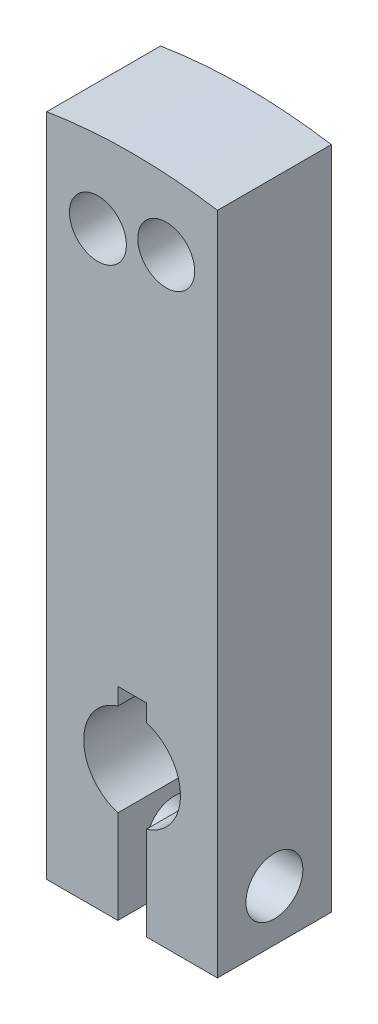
ISO-10303-21;
HEADER;
FILE_DESCRIPTION(('STEP AP214'),'2;1');
FILE_NAME('part.step','',(''),(''),'','','');
FILE_SCHEMA(('AUTOMOTIVE_DESIGN { 1 0 10303 214 1 1 1 1 }'));
ENDSEC;
DATA;
#1=APPLICATION_CONTEXT('core data for automotive mechanical design processes');
#2=APPLICATION_PROTOCOL_DEFINITION('international standard','automotive_design',2000,#1);
#3=PRODUCT_CONTEXT('',#1,'mechanical');
#4=PRODUCT('Part','Part','',(#3));
#5=PRODUCT_RELATED_PRODUCT_CATEGORY('part','',(#4));
#6=PRODUCT_DEFINITION_FORMATION('','',#4);
#7=PRODUCT_DEFINITION_CONTEXT('part definition',#1,'design');
#8=PRODUCT_DEFINITION('design','',#6,#7);
#9=PRODUCT_DEFINITION_SHAPE('','',#8);
#10=(LENGTH_UNIT() NAMED_UNIT(*) SI_UNIT(.MILLI.,.METRE.));
#11=(NAMED_UNIT(*) PLANE_ANGLE_UNIT() SI_UNIT($,.RADIAN.));
#12=(NAMED_UNIT(*) SI_UNIT($,.STERADIAN.) SOLID_ANGLE_UNIT());
#13=UNCERTAINTY_MEASURE_WITH_UNIT(LENGTH_MEASURE(1.E-05),#10,'distance_accuracy_value','');
#14=(GEOMETRIC_REPRESENTATION_CONTEXT(3) GLOBAL_UNCERTAINTY_ASSIGNED_CONTEXT((#13)) GLOBAL_UNIT_ASSIGNED_CONTEXT((#10,
#11,#12)) REPRESENTATION_CONTEXT('',''));
#15=CARTESIAN_POINT('',(0.,0.,0.));
#16=DIRECTION('',(0.,0.,1.));
#17=DIRECTION('',(1.,0.,0.));
#18=AXIS2_PLACEMENT_3D('',#15,#16,#17);
#19=CARTESIAN_POINT('',(0.,0.,-20.));
#20=DIRECTION('',(0.,0.,1.));
#21=DIRECTION('',(1.,0.,0.));
#22=AXIS2_PLACEMENT_3D('',#19,#20,#21);
#23=CYLINDRICAL_SURFACE('',#22,8.5);
#24=CARTESIAN_POINT('',(0.,0.,0.));
#25=DIRECTION('',(0.,0.,-1.));
#26=DIRECTION('',(1.,0.,0.));
#27=AXIS2_PLACEMENT_3D('',#24,#25,#26);
#28=CIRCLE('',#27,8.5);
#29=CARTESIAN_POINT('',(-2.5,-8.12403840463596,0.));
#30=VERTEX_POINT('',#29);
#31=CARTESIAN_POINT('',(-2.49999999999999,8.12403840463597,0.));
#32=VERTEX_POINT('',#31);
#33=EDGE_CURVE('E126',#30,#32,#28,.T.);
#34=ORIENTED_EDGE('',*,*,#33,.F.);
#35=DIRECTION('',(0.,0.,1.));
#36=VECTOR('',#35,1.);
#37=CARTESIAN_POINT('',(-2.5,-8.12403840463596,-20.));
#38=LINE('',#37,#36);
#39=CARTESIAN_POINT('',(-2.5,-8.12403840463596,-20.));
#40=VERTEX_POINT('',#39);
#41=EDGE_CURVE('E12',#40,#30,#38,.T.);
#42=ORIENTED_EDGE('',*,*,#41,.F.);
#43=CARTESIAN_POINT('',(0.,0.,-20.));
#44=DIRECTION('',(0.,0.,-1.));
#45=DIRECTION('',(1.,0.,0.));
#46=AXIS2_PLACEMENT_3D('',#43,#44,#45);
#47=CIRCLE('',#46,8.5);
#48=CARTESIAN_POINT('',(-2.49999999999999,8.12403840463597,-20.));
#49=VERTEX_POINT('',#48);
#50=EDGE_CURVE('E128',#40,#49,#47,.T.);
#51=ORIENTED_EDGE('',*,*,#50,.T.);
#52=DIRECTION('',(0.,0.,1.));
#53=VECTOR('',#52,1.);
#54=CARTESIAN_POINT('',(-2.49999999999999,8.12403840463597,-20.));
#55=LINE('',#54,#53);
#56=EDGE_CURVE('E123',#49,#32,#55,.T.);
#57=ORIENTED_EDGE('',*,*,#56,.T.);
#58=EDGE_LOOP('',(#34,#42,#51,#57));
#59=FACE_BOUND('',#58,.T.);
#60=ADVANCED_FACE('F37',(#59),#23,.F.);
#61=CARTESIAN_POINT('',(-2.5,-8.12403840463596,-20.));
#62=DIRECTION('',(1.,0.,0.));
#63=DIRECTION('',(0.,1.,0.));
#64=AXIS2_PLACEMENT_3D('',#61,#62,#63);
#65=PLANE('',#64);
#66=CARTESIAN_POINT('',(-2.5,-15.5,-10.));
#67=DIRECTION('',(1.,0.,0.));
#68=DIRECTION('',(0.,1.,0.));
#69=AXIS2_PLACEMENT_3D('',#66,#67,#68);
#70=CIRCLE('',#69,5.);
#71=CARTESIAN_POINT('',(-2.5,-10.5,-10.));
#72=VERTEX_POINT('',#71);
#73=EDGE_CURVE('E145',#72,#72,#70,.T.);
#74=ORIENTED_EDGE('',*,*,#73,.F.);
#75=EDGE_LOOP('',(#74));
#76=FACE_BOUND('',#75,.T.);
#77=DIRECTION('',(0.,1.,0.));
#78=VECTOR('',#77,1.);
#79=CARTESIAN_POINT('',(-2.5,-8.12403840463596,0.));
#80=LINE('',#79,#78);
#81=CARTESIAN_POINT('',(-2.5,-24.5,0.));
#82=VERTEX_POINT('',#81);
#83=EDGE_CURVE('E144',#82,#30,#80,.T.);
#84=ORIENTED_EDGE('',*,*,#83,.F.);
#85=DIRECTION('',(0.,0.,1.));
#86=VECTOR('',#85,1.);
#87=CARTESIAN_POINT('',(-2.5,-24.5,-20.));
#88=LINE('',#87,#86);
#89=CARTESIAN_POINT('',(-2.5,-24.5,-20.));
#90=VERTEX_POINT('',#89);
#91=EDGE_CURVE('E45',#90,#82,#88,.T.);
#92=ORIENTED_EDGE('',*,*,#91,.F.);
#93=DIRECTION('',(0.,1.,0.));
#94=VECTOR('',#93,1.);
#95=CARTESIAN_POINT('',(-2.5,-8.12403840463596,-20.));
#96=LINE('',#95,#94);
#97=EDGE_CURVE('E133',#90,#40,#96,.T.);
#98=ORIENTED_EDGE('',*,*,#97,.T.);
#99=ORIENTED_EDGE('',*,*,#41,.T.);
#100=EDGE_LOOP('',(#84,#92,#98,#99));
#101=FACE_BOUND('',#100,.T.);
#102=ADVANCED_FACE('F257',(#76,#101),#65,.T.);
#103=CARTESIAN_POINT('',(-15.,-24.5,-20.));
#104=DIRECTION('',(0.,-1.,0.));
#105=DIRECTION('',(1.,0.,0.));
#106=AXIS2_PLACEMENT_3D('',#103,#104,#105);
#107=PLANE('',#106);
#108=DIRECTION('',(1.,0.,0.));
#109=VECTOR('',#108,1.);
#110=CARTESIAN_POINT('',(-15.,-24.5,0.));
#111=LINE('',#110,#109);
#112=CARTESIAN_POINT('',(-15.,-24.5,0.));
#113=VERTEX_POINT('',#112);
#114=EDGE_CURVE('E174',#113,#82,#111,.T.);
#115=ORIENTED_EDGE('',*,*,#114,.F.);
#116=DIRECTION('',(0.,0.,1.));
#117=VECTOR('',#116,1.);
#118=CARTESIAN_POINT('',(-15.,-24.5,-20.));
#119=LINE('',#118,#117);
#120=CARTESIAN_POINT('',(-15.,-24.5,-20.));
#121=VERTEX_POINT('',#120);
#122=EDGE_CURVE('E208',#121,#113,#119,.T.);
#123=ORIENTED_EDGE('',*,*,#122,.F.);
#124=DIRECTION('',(1.,0.,0.));
#125=VECTOR('',#124,1.);
#126=CARTESIAN_POINT('',(-15.,-24.5,-20.));
#127=LINE('',#126,#125);
#128=EDGE_CURVE('E204',#121,#90,#127,.T.);
#129=ORIENTED_EDGE('',*,*,#128,.T.);
#130=ORIENTED_EDGE('',*,*,#91,.T.);
#131=EDGE_LOOP('',(#115,#123,#129,#130));
#132=FACE_BOUND('',#131,.T.);
#133=ADVANCED_FACE('F262',(#132),#107,.T.);
#134=CARTESIAN_POINT('',(-15.,92.2889484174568,-20.));
#135=DIRECTION('',(-1.,0.,0.));
#136=DIRECTION('',(0.,-1.,0.));
#137=AXIS2_PLACEMENT_3D('',#134,#135,#136);
#138=PLANE('',#137);
#139=CARTESIAN_POINT('',(-15.,-15.5,-10.));
#140=DIRECTION('',(-1.,0.,0.));
#141=DIRECTION('',(0.,-1.,0.));
#142=AXIS2_PLACEMENT_3D('',#139,#140,#141);
#143=CIRCLE('',#142,5.);
#144=CARTESIAN_POINT('',(-15.,-20.5,-10.));
#145=VERTEX_POINT('',#144);
#146=EDGE_CURVE('E148',#145,#145,#143,.T.);
#147=ORIENTED_EDGE('',*,*,#146,.F.);
#148=EDGE_LOOP('',(#147));
#149=FACE_BOUND('',#148,.T.);
#150=DIRECTION('',(0.,-1.,0.));
#151=VECTOR('',#150,1.);
#152=CARTESIAN_POINT('',(-15.,92.2889484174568,0.));
#153=LINE('',#152,#151);
#154=CARTESIAN_POINT('',(-15.,92.2889484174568,0.));
#155=VERTEX_POINT('',#154);
#156=EDGE_CURVE('E170',#155,#113,#153,.T.);
#157=ORIENTED_EDGE('',*,*,#156,.F.);
#158=DIRECTION('',(0.,0.,1.));
#159=VECTOR('',#158,1.);
#160=CARTESIAN_POINT('',(-15.,92.2889484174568,-20.));
#161=LINE('',#160,#159);
#162=CARTESIAN_POINT('',(-15.,92.2889484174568,-20.));
#163=VERTEX_POINT('',#162);
#164=EDGE_CURVE('E210',#163,#155,#161,.T.);
#165=ORIENTED_EDGE('',*,*,#164,.F.);
#166=DIRECTION('',(0.,-1.,0.));
#167=VECTOR('',#166,1.);
#168=CARTESIAN_POINT('',(-15.,92.2889484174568,-20.));
#169=LINE('',#168,#167);
#170=EDGE_CURVE('E201',#163,#121,#169,.T.);
#171=ORIENTED_EDGE('',*,*,#170,.T.);
#172=ORIENTED_EDGE('',*,*,#122,.T.);
#173=EDGE_LOOP('',(#157,#165,#171,#172));
#174=FACE_BOUND('',#173,.T.);
#175=ADVANCED_FACE('F254',(#149,#174),#138,.T.);
#176=CARTESIAN_POINT('',(0.,0.,-20.));
#177=DIRECTION('',(0.,0.,1.));
#178=DIRECTION('',(1.,0.,0.));
#179=AXIS2_PLACEMENT_3D('',#176,#177,#178);
#180=CYLINDRICAL_SURFACE('',#179,93.5);
#181=CARTESIAN_POINT('',(0.,0.,0.));
#182=DIRECTION('',(0.,0.,1.));
#183=DIRECTION('',(1.,0.,0.));
#184=AXIS2_PLACEMENT_3D('',#181,#182,#183);
#185=CIRCLE('',#184,93.5);
#186=CARTESIAN_POINT('',(15.,92.2889484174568,0.));
#187=VERTEX_POINT('',#186);
#188=EDGE_CURVE('E168',#187,#155,#185,.T.);
#189=ORIENTED_EDGE('',*,*,#188,.F.);
#190=DIRECTION('',(0.,0.,1.));
#191=VECTOR('',#190,1.);
#192=CARTESIAN_POINT('',(15.,92.2889484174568,-20.));
#193=LINE('',#192,#191);
#194=CARTESIAN_POINT('',(15.,92.2889484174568,-20.));
#195=VERTEX_POINT('',#194);
#196=EDGE_CURVE('E212',#195,#187,#193,.T.);
#197=ORIENTED_EDGE('',*,*,#196,.F.);
#198=CARTESIAN_POINT('',(0.,0.,-20.));
#199=DIRECTION('',(0.,0.,1.));
#200=DIRECTION('',(1.,0.,0.));
#201=AXIS2_PLACEMENT_3D('',#198,#199,#200);
#202=CIRCLE('',#201,93.5);
#203=EDGE_CURVE('E198',#195,#163,#202,.T.);
#204=ORIENTED_EDGE('',*,*,#203,.T.);
#205=ORIENTED_EDGE('',*,*,#164,.T.);
#206=EDGE_LOOP('',(#189,#197,#204,#205));
#207=FACE_BOUND('',#206,.T.);
#208=ADVANCED_FACE('F250',(#207),#180,.T.);
#209=CARTESIAN_POINT('',(15.,92.2889484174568,-20.));
#210=DIRECTION('',(1.,0.,0.));
#211=DIRECTION('',(0.,1.,0.));
#212=AXIS2_PLACEMENT_3D('',#209,#210,#211);
#213=PLANE('',#212);
#214=CARTESIAN_POINT('',(15.,-15.5,-10.));
#215=DIRECTION('',(1.,0.,0.));
#216=DIRECTION('',(0.,1.,0.));
#217=AXIS2_PLACEMENT_3D('',#214,#215,#216);
#218=CIRCLE('',#217,5.);
#219=CARTESIAN_POINT('',(15.,-10.5,-10.));
#220=VERTEX_POINT('',#219);
#221=EDGE_CURVE('E432',#220,#220,#218,.T.);
#222=ORIENTED_EDGE('',*,*,#221,.F.);
#223=EDGE_LOOP('',(#222));
#224=FACE_BOUND('',#223,.T.);
#225=DIRECTION('',(0.,1.,0.));
#226=VECTOR('',#225,1.);
#227=CARTESIAN_POINT('',(15.,92.2889484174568,0.));
#228=LINE('',#227,#226);
#229=CARTESIAN_POINT('',(15.,-24.5,0.));
#230=VERTEX_POINT('',#229);
#231=EDGE_CURVE('E165',#230,#187,#228,.T.);
#232=ORIENTED_EDGE('',*,*,#231,.F.);
#233=DIRECTION('',(0.,0.,1.));
#234=VECTOR('',#233,1.);
#235=CARTESIAN_POINT('',(15.,-24.5,-20.));
#236=LINE('',#235,#234);
#237=CARTESIAN_POINT('',(15.,-24.5,-20.));
#238=VERTEX_POINT('',#237);
#239=EDGE_CURVE('E214',#238,#230,#236,.T.);
#240=ORIENTED_EDGE('',*,*,#239,.F.);
#241=DIRECTION('',(0.,1.,0.));
#242=VECTOR('',#241,1.);
#243=CARTESIAN_POINT('',(15.,92.2889484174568,-20.));
#244=LINE('',#243,#242);
#245=EDGE_CURVE('E195',#238,#195,#244,.T.);
#246=ORIENTED_EDGE('',*,*,#245,.T.);
#247=ORIENTED_EDGE('',*,*,#196,.T.);
#248=EDGE_LOOP('',(#232,#240,#246,#247));
#249=FACE_BOUND('',#248,.T.);
#250=ADVANCED_FACE('F246',(#224,#249),#213,.T.);
#251=CARTESIAN_POINT('',(15.,-24.5,-20.));
#252=DIRECTION('',(0.,-1.,0.));
#253=DIRECTION('',(1.,0.,0.));
#254=AXIS2_PLACEMENT_3D('',#251,#252,#253);
#255=PLANE('',#254);
#256=DIRECTION('',(1.,0.,0.));
#257=VECTOR('',#256,1.);
#258=CARTESIAN_POINT('',(15.,-24.5,0.));
#259=LINE('',#258,#257);
#260=CARTESIAN_POINT('',(2.5,-24.5,0.));
#261=VERTEX_POINT('',#260);
#262=EDGE_CURVE('E162',#261,#230,#259,.T.);
#263=ORIENTED_EDGE('',*,*,#262,.F.);
#264=DIRECTION('',(0.,0.,1.));
#265=VECTOR('',#264,1.);
#266=CARTESIAN_POINT('',(2.5,-24.5,-20.));
#267=LINE('',#266,#265);
#268=CARTESIAN_POINT('',(2.5,-24.5,-20.));
#269=VERTEX_POINT('',#268);
#270=EDGE_CURVE('E216',#269,#261,#267,.T.);
#271=ORIENTED_EDGE('',*,*,#270,.F.);
#272=DIRECTION('',(1.,0.,0.));
#273=VECTOR('',#272,1.);
#274=CARTESIAN_POINT('',(15.,-24.5,-20.));
#275=LINE('',#274,#273);
#276=EDGE_CURVE('E192',#269,#238,#275,.T.);
#277=ORIENTED_EDGE('',*,*,#276,.T.);
#278=ORIENTED_EDGE('',*,*,#239,.T.);
#279=EDGE_LOOP('',(#263,#271,#277,#278));
#280=FACE_BOUND('',#279,.T.);
#281=ADVANCED_FACE('F242',(#280),#255,.T.);
#282=CARTESIAN_POINT('',(2.5,-8.12403840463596,-20.));
#283=DIRECTION('',(-1.,0.,0.));
#284=DIRECTION('',(0.,-1.,0.));
#285=AXIS2_PLACEMENT_3D('',#282,#283,#284);
#286=PLANE('',#285);
#287=CARTESIAN_POINT('',(2.5,-15.5,-10.));
#288=DIRECTION('',(-1.,0.,0.));
#289=DIRECTION('',(0.,-1.,0.));
#290=AXIS2_PLACEMENT_3D('',#287,#288,#289);
#291=CIRCLE('',#290,5.);
#292=CARTESIAN_POINT('',(2.5,-20.5,-10.));
#293=VERTEX_POINT('',#292);
#294=EDGE_CURVE('E40',#293,#293,#291,.T.);
#295=ORIENTED_EDGE('',*,*,#294,.F.);
#296=EDGE_LOOP('',(#295));
#297=FACE_BOUND('',#296,.T.);
#298=DIRECTION('',(0.,-1.,0.));
#299=VECTOR('',#298,1.);
#300=CARTESIAN_POINT('',(2.5,-8.12403840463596,0.));
#301=LINE('',#300,#299);
#302=CARTESIAN_POINT('',(2.5,-8.12403840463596,0.));
#303=VERTEX_POINT('',#302);
#304=EDGE_CURVE('E159',#303,#261,#301,.T.);
#305=ORIENTED_EDGE('',*,*,#304,.F.);
#306=DIRECTION('',(0.,0.,1.));
#307=VECTOR('',#306,1.);
#308=CARTESIAN_POINT('',(2.5,-8.12403840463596,-20.));
#309=LINE('',#308,#307);
#310=CARTESIAN_POINT('',(2.5,-8.12403840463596,-20.));
#311=VERTEX_POINT('',#310);
#312=EDGE_CURVE('E218',#311,#303,#309,.T.);
#313=ORIENTED_EDGE('',*,*,#312,.F.);
#314=DIRECTION('',(0.,-1.,0.));
#315=VECTOR('',#314,1.);
#316=CARTESIAN_POINT('',(2.5,-8.12403840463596,-20.));
#317=LINE('',#316,#315);
#318=EDGE_CURVE('E189',#311,#269,#317,.T.);
#319=ORIENTED_EDGE('',*,*,#318,.T.);
#320=ORIENTED_EDGE('',*,*,#270,.T.);
#321=EDGE_LOOP('',(#305,#313,#319,#320));
#322=FACE_BOUND('',#321,.T.);
#323=ADVANCED_FACE('F238',(#297,#322),#286,.T.);
#324=CARTESIAN_POINT('',(0.,0.,-20.));
#325=DIRECTION('',(0.,0.,1.));
#326=DIRECTION('',(1.,0.,0.));
#327=AXIS2_PLACEMENT_3D('',#324,#325,#326);
#328=CYLINDRICAL_SURFACE('',#327,8.5);
#329=CARTESIAN_POINT('',(0.,0.,0.));
#330=DIRECTION('',(0.,0.,-1.));
#331=DIRECTION('',(-1.,0.,0.));
#332=AXIS2_PLACEMENT_3D('',#329,#330,#331);
#333=CIRCLE('',#332,8.5);
#334=CARTESIAN_POINT('',(2.49999999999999,8.12403840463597,0.));
#335=VERTEX_POINT('',#334);
#336=EDGE_CURVE('E156',#335,#303,#333,.T.);
#337=ORIENTED_EDGE('',*,*,#336,.F.);
#338=DIRECTION('',(0.,0.,1.));
#339=VECTOR('',#338,1.);
#340=CARTESIAN_POINT('',(2.49999999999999,8.12403840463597,-20.));
#341=LINE('',#340,#339);
#342=CARTESIAN_POINT('',(2.49999999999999,8.12403840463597,-20.));
#343=VERTEX_POINT('',#342);
#344=EDGE_CURVE('E220',#343,#335,#341,.T.);
#345=ORIENTED_EDGE('',*,*,#344,.F.);
#346=CARTESIAN_POINT('',(0.,0.,-20.));
#347=DIRECTION('',(0.,0.,-1.));
#348=DIRECTION('',(-1.,0.,0.));
#349=AXIS2_PLACEMENT_3D('',#346,#347,#348);
#350=CIRCLE('',#349,8.5);
#351=EDGE_CURVE('E186',#343,#311,#350,.T.);
#352=ORIENTED_EDGE('',*,*,#351,.T.);
#353=ORIENTED_EDGE('',*,*,#312,.T.);
#354=EDGE_LOOP('',(#337,#345,#352,#353));
#355=FACE_BOUND('',#354,.T.);
#356=ADVANCED_FACE('F234',(#355),#328,.F.);
#357=CARTESIAN_POINT('',(2.49999999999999,11.124038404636,-20.));
#358=DIRECTION('',(-1.,0.,0.));
#359=DIRECTION('',(0.,-1.,0.));
#360=AXIS2_PLACEMENT_3D('',#357,#358,#359);
#361=PLANE('',#360);
#362=DIRECTION('',(0.,-1.,0.));
#363=VECTOR('',#362,1.);
#364=CARTESIAN_POINT('',(2.49999999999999,11.124038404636,0.));
#365=LINE('',#364,#363);
#366=CARTESIAN_POINT('',(2.49999999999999,11.124038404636,0.));
#367=VERTEX_POINT('',#366);
#368=EDGE_CURVE('E153',#367,#335,#365,.T.);
#369=ORIENTED_EDGE('',*,*,#368,.F.);
#370=DIRECTION('',(0.,0.,1.));
#371=VECTOR('',#370,1.);
#372=CARTESIAN_POINT('',(2.49999999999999,11.124038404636,-20.));
#373=LINE('',#372,#371);
#374=CARTESIAN_POINT('',(2.49999999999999,11.124038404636,-20.));
#375=VERTEX_POINT('',#374);
#376=EDGE_CURVE('E222',#375,#367,#373,.T.);
#377=ORIENTED_EDGE('',*,*,#376,.F.);
#378=DIRECTION('',(0.,-1.,0.));
#379=VECTOR('',#378,1.);
#380=CARTESIAN_POINT('',(2.49999999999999,11.124038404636,-20.));
#381=LINE('',#380,#379);
#382=EDGE_CURVE('E183',#375,#343,#381,.T.);
#383=ORIENTED_EDGE('',*,*,#382,.T.);
#384=ORIENTED_EDGE('',*,*,#344,.T.);
#385=EDGE_LOOP('',(#369,#377,#383,#384));
#386=FACE_BOUND('',#385,.T.);
#387=ADVANCED_FACE('F230',(#386),#361,.T.);
#388=CARTESIAN_POINT('',(-2.49999999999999,11.124038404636,-20.));
#389=DIRECTION('',(0.,-1.,0.));
#390=DIRECTION('',(0.,0.,-1.));
#391=AXIS2_PLACEMENT_3D('',#388,#389,#390);
#392=PLANE('',#391);
#393=DIRECTION('',(1.,0.,0.));
#394=VECTOR('',#393,1.);
#395=CARTESIAN_POINT('',(-2.49999999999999,11.124038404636,0.));
#396=LINE('',#395,#394);
#397=CARTESIAN_POINT('',(-2.49999999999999,11.124038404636,0.));
#398=VERTEX_POINT('',#397);
#399=EDGE_CURVE('E140',#398,#367,#396,.T.);
#400=ORIENTED_EDGE('',*,*,#399,.F.);
#401=DIRECTION('',(0.,0.,1.));
#402=VECTOR('',#401,1.);
#403=CARTESIAN_POINT('',(-2.49999999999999,11.124038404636,-20.));
#404=LINE('',#403,#402);
#405=CARTESIAN_POINT('',(-2.49999999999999,11.124038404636,-20.));
#406=VERTEX_POINT('',#405);
#407=EDGE_CURVE('E132',#406,#398,#404,.T.);
#408=ORIENTED_EDGE('',*,*,#407,.F.);
#409=DIRECTION('',(1.,0.,0.));
#410=VECTOR('',#409,1.);
#411=CARTESIAN_POINT('',(-2.49999999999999,11.124038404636,-20.));
#412=LINE('',#411,#410);
#413=EDGE_CURVE('E180',#406,#375,#412,.T.);
#414=ORIENTED_EDGE('',*,*,#413,.T.);
#415=ORIENTED_EDGE('',*,*,#376,.T.);
#416=EDGE_LOOP('',(#400,#408,#414,#415));
#417=FACE_BOUND('',#416,.T.);
#418=ADVANCED_FACE('F226',(#417),#392,.T.);
#419=CARTESIAN_POINT('',(-2.49999999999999,11.124038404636,-20.));
#420=DIRECTION('',(1.,0.,0.));
#421=DIRECTION('',(0.,1.,0.));
#422=AXIS2_PLACEMENT_3D('',#419,#420,#421);
#423=PLANE('',#422);
#424=DIRECTION('',(0.,1.,0.));
#425=VECTOR('',#424,1.);
#426=CARTESIAN_POINT('',(-2.49999999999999,11.124038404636,0.));
#427=LINE('',#426,#425);
#428=EDGE_CURVE('E135',#32,#398,#427,.T.);
#429=ORIENTED_EDGE('',*,*,#428,.F.);
#430=ORIENTED_EDGE('',*,*,#56,.F.);
#431=DIRECTION('',(0.,1.,0.));
#432=VECTOR('',#431,1.);
#433=CARTESIAN_POINT('',(-2.49999999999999,11.124038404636,-20.));
#434=LINE('',#433,#432);
#435=EDGE_CURVE('E178',#49,#406,#434,.T.);
#436=ORIENTED_EDGE('',*,*,#435,.T.);
#437=ORIENTED_EDGE('',*,*,#407,.T.);
#438=EDGE_LOOP('',(#429,#430,#436,#437));
#439=FACE_BOUND('',#438,.T.);
#440=ADVANCED_FACE('F136',(#439),#423,.T.);
#441=CARTESIAN_POINT('',(0.,0.,-20.));
#442=DIRECTION('',(0.,0.,1.));
#443=DIRECTION('',(1.,0.,0.));
#444=AXIS2_PLACEMENT_3D('',#441,#442,#443);
#445=PLANE('',#444);
#446=CARTESIAN_POINT('',(-6.,79.,-20.));
#447=DIRECTION('',(0.,0.,1.));
#448=DIRECTION('',(1.,0.,0.));
#449=AXIS2_PLACEMENT_3D('',#446,#447,#448);
#450=CIRCLE('',#449,5.);
#451=CARTESIAN_POINT('',(-0.999999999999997,79.,-20.));
#452=VERTEX_POINT('',#451);
#453=EDGE_CURVE('E419',#452,#452,#450,.T.);
#454=ORIENTED_EDGE('',*,*,#453,.T.);
#455=EDGE_LOOP('',(#454));
#456=FACE_BOUND('',#455,.T.);
#457=CARTESIAN_POINT('',(6.,81.,-20.));
#458=DIRECTION('',(0.,0.,1.));
#459=DIRECTION('',(1.,0.,0.));
#460=AXIS2_PLACEMENT_3D('',#457,#458,#459);
#461=CIRCLE('',#460,5.);
#462=CARTESIAN_POINT('',(11.,81.,-20.));
#463=VERTEX_POINT('',#462);
#464=EDGE_CURVE('E429',#463,#463,#461,.T.);
#465=ORIENTED_EDGE('',*,*,#464,.T.);
#466=EDGE_LOOP('',(#465));
#467=FACE_BOUND('',#466,.T.);
#468=ORIENTED_EDGE('',*,*,#50,.F.);
#469=ORIENTED_EDGE('',*,*,#97,.F.);
#470=ORIENTED_EDGE('',*,*,#128,.F.);
#471=ORIENTED_EDGE('',*,*,#170,.F.);
#472=ORIENTED_EDGE('',*,*,#203,.F.);
#473=ORIENTED_EDGE('',*,*,#245,.F.);
#474=ORIENTED_EDGE('',*,*,#276,.F.);
#475=ORIENTED_EDGE('',*,*,#318,.F.);
#476=ORIENTED_EDGE('',*,*,#351,.F.);
#477=ORIENTED_EDGE('',*,*,#382,.F.);
#478=ORIENTED_EDGE('',*,*,#413,.F.);
#479=ORIENTED_EDGE('',*,*,#435,.F.);
#480=EDGE_LOOP('',(#468,#469,#470,#471,#472,#473,#474,#475,#476,#477,#478,#479));
#481=FACE_BOUND('',#480,.T.);
#482=ADVANCED_FACE('F261',(#456,#467,#481),#445,.F.);
#483=CARTESIAN_POINT('',(0.,0.,0.));
#484=DIRECTION('',(0.,0.,1.));
#485=DIRECTION('',(1.,0.,0.));
#486=AXIS2_PLACEMENT_3D('',#483,#484,#485);
#487=PLANE('',#486);
#488=CARTESIAN_POINT('',(-6.,79.,0.));
#489=DIRECTION('',(0.,0.,1.));
#490=DIRECTION('',(1.,0.,0.));
#491=AXIS2_PLACEMENT_3D('',#488,#489,#490);
#492=CIRCLE('',#491,5.);
#493=CARTESIAN_POINT('',(-0.999999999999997,79.,0.));
#494=VERTEX_POINT('',#493);
#495=EDGE_CURVE('E422',#494,#494,#492,.T.);
#496=ORIENTED_EDGE('',*,*,#495,.F.);
#497=EDGE_LOOP('',(#496));
#498=FACE_BOUND('',#497,.T.);
#499=CARTESIAN_POINT('',(6.,81.,0.));
#500=DIRECTION('',(0.,0.,1.));
#501=DIRECTION('',(1.,0.,0.));
#502=AXIS2_PLACEMENT_3D('',#499,#500,#501);
#503=CIRCLE('',#502,5.);
#504=CARTESIAN_POINT('',(11.,81.,0.));
#505=VERTEX_POINT('',#504);
#506=EDGE_CURVE('E424',#505,#505,#503,.T.);
#507=ORIENTED_EDGE('',*,*,#506,.F.);
#508=EDGE_LOOP('',(#507));
#509=FACE_BOUND('',#508,.T.);
#510=ORIENTED_EDGE('',*,*,#33,.T.);
#511=ORIENTED_EDGE('',*,*,#428,.T.);
#512=ORIENTED_EDGE('',*,*,#399,.T.);
#513=ORIENTED_EDGE('',*,*,#368,.T.);
#514=ORIENTED_EDGE('',*,*,#336,.T.);
#515=ORIENTED_EDGE('',*,*,#304,.T.);
#516=ORIENTED_EDGE('',*,*,#262,.T.);
#517=ORIENTED_EDGE('',*,*,#231,.T.);
#518=ORIENTED_EDGE('',*,*,#188,.T.);
#519=ORIENTED_EDGE('',*,*,#156,.T.);
#520=ORIENTED_EDGE('',*,*,#114,.T.);
#521=ORIENTED_EDGE('',*,*,#83,.T.);
#522=EDGE_LOOP('',(#510,#511,#512,#513,#514,#515,#516,#517,#518,#519,#520,#521));
#523=FACE_BOUND('',#522,.T.);
#524=ADVANCED_FACE('F142',(#498,#509,#523),#487,.T.);
#525=CARTESIAN_POINT('',(-20.,-15.5,-10.));
#526=DIRECTION('',(1.,0.,0.));
#527=DIRECTION('',(0.,0.,-1.));
#528=AXIS2_PLACEMENT_3D('',#525,#526,#527);
#529=CYLINDRICAL_SURFACE('',#528,5.);
#530=ORIENTED_EDGE('',*,*,#221,.T.);
#531=EDGE_LOOP('',(#530));
#532=FACE_BOUND('',#531,.T.);
#533=ORIENTED_EDGE('',*,*,#294,.T.);
#534=EDGE_LOOP('',(#533));
#535=FACE_BOUND('',#534,.T.);
#536=ADVANCED_FACE('F373',(#532,#535),#529,.F.);
#537=ORIENTED_EDGE('',*,*,#73,.T.);
#538=EDGE_LOOP('',(#537));
#539=FACE_BOUND('',#538,.T.);
#540=ORIENTED_EDGE('',*,*,#146,.T.);
#541=EDGE_LOOP('',(#540));
#542=FACE_BOUND('',#541,.T.);
#543=ADVANCED_FACE('F383',(#539,#542),#529,.F.);
#544=CARTESIAN_POINT('',(6.,81.,-20.));
#545=DIRECTION('',(0.,0.,1.));
#546=DIRECTION('',(1.,0.,0.));
#547=AXIS2_PLACEMENT_3D('',#544,#545,#546);
#548=CYLINDRICAL_SURFACE('',#547,5.);
#549=ORIENTED_EDGE('',*,*,#464,.F.);
#550=EDGE_LOOP('',(#549));
#551=FACE_BOUND('',#550,.T.);
#552=ORIENTED_EDGE('',*,*,#506,.T.);
#553=EDGE_LOOP('',(#552));
#554=FACE_BOUND('',#553,.T.);
#555=ADVANCED_FACE('F393',(#551,#554),#548,.F.);
#556=CARTESIAN_POINT('',(-6.,79.,-20.));
#557=DIRECTION('',(0.,0.,1.));
#558=DIRECTION('',(1.,0.,0.));
#559=AXIS2_PLACEMENT_3D('',#556,#557,#558);
#560=CYLINDRICAL_SURFACE('',#559,5.);
#561=ORIENTED_EDGE('',*,*,#453,.F.);
#562=EDGE_LOOP('',(#561));
#563=FACE_BOUND('',#562,.T.);
#564=ORIENTED_EDGE('',*,*,#495,.T.);
#565=EDGE_LOOP('',(#564));
#566=FACE_BOUND('',#565,.T.);
#567=ADVANCED_FACE('F402',(#563,#566),#560,.F.);
#568=CLOSED_SHELL('',(#60,#102,#133,#175,#208,#250,#281,#323,#356,#387,#418,#440,#482,#524,#536,
#543,#555,#567));
#569=MANIFOLD_SOLID_BREP('B2',#568);
#570=ADVANCED_BREP_SHAPE_REPRESENTATION('',(#18,#569),#14);
#571=SHAPE_DEFINITION_REPRESENTATION(#9,#570);
ENDSEC;
END-ISO-10303-21;
